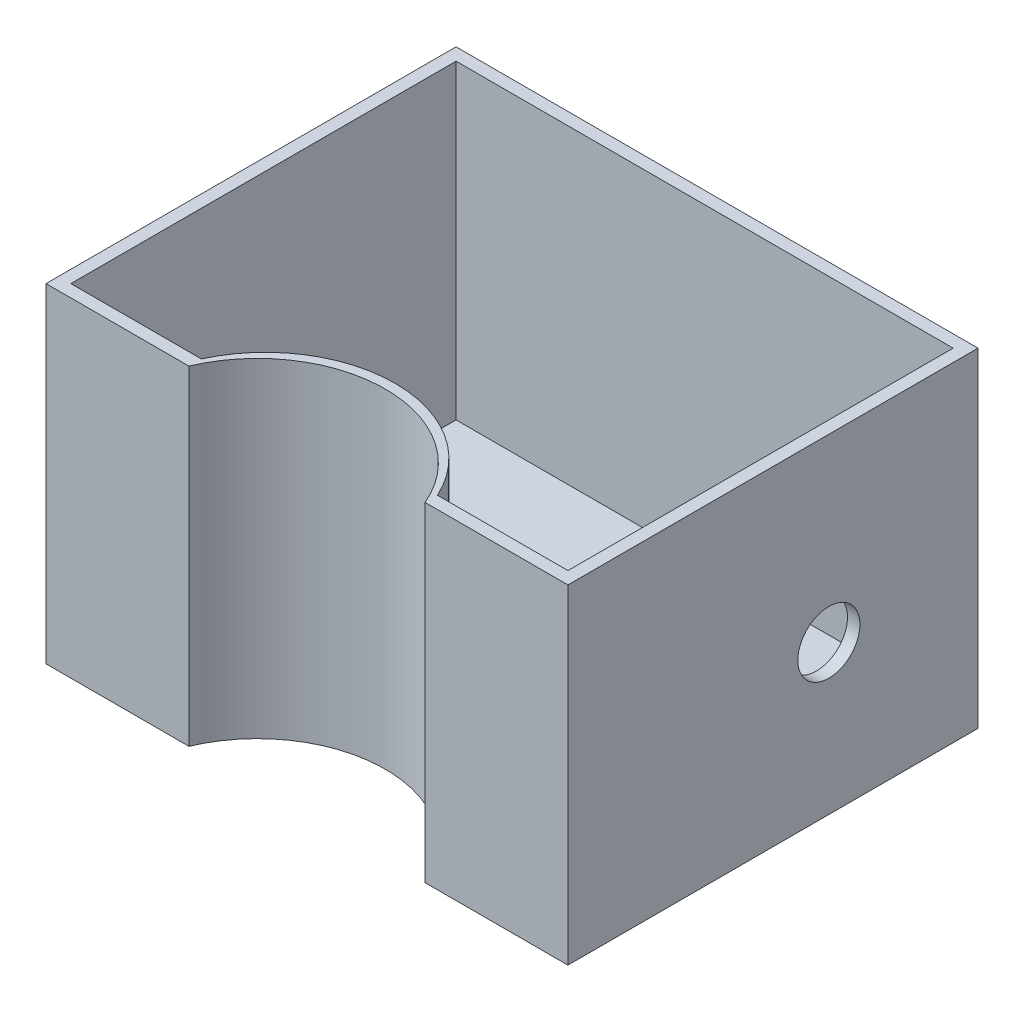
ISO-10303-21;
HEADER;
FILE_DESCRIPTION(('STEP AP214'),'2;1');
FILE_NAME('part.step','',(''),(''),'','','');
FILE_SCHEMA(('AUTOMOTIVE_DESIGN { 1 0 10303 214 1 1 1 1 }'));
ENDSEC;
DATA;
#1=APPLICATION_CONTEXT('core data for automotive mechanical design processes');
#2=APPLICATION_PROTOCOL_DEFINITION('international standard','automotive_design',2000,#1);
#3=PRODUCT_CONTEXT('',#1,'mechanical');
#4=PRODUCT('Part','Part','',(#3));
#5=PRODUCT_RELATED_PRODUCT_CATEGORY('part','',(#4));
#6=PRODUCT_DEFINITION_FORMATION('','',#4);
#7=PRODUCT_DEFINITION_CONTEXT('part definition',#1,'design');
#8=PRODUCT_DEFINITION('design','',#6,#7);
#9=PRODUCT_DEFINITION_SHAPE('','',#8);
#10=(LENGTH_UNIT() NAMED_UNIT(*) SI_UNIT(.MILLI.,.METRE.));
#11=(NAMED_UNIT(*) PLANE_ANGLE_UNIT() SI_UNIT($,.RADIAN.));
#12=(NAMED_UNIT(*) SI_UNIT($,.STERADIAN.) SOLID_ANGLE_UNIT());
#13=UNCERTAINTY_MEASURE_WITH_UNIT(LENGTH_MEASURE(1.E-05),#10,'distance_accuracy_value','');
#14=(GEOMETRIC_REPRESENTATION_CONTEXT(3) GLOBAL_UNCERTAINTY_ASSIGNED_CONTEXT((#13)) GLOBAL_UNIT_ASSIGNED_CONTEXT((#10,
#11,#12)) REPRESENTATION_CONTEXT('',''));
#15=CARTESIAN_POINT('',(0.,0.,0.));
#16=DIRECTION('',(0.,0.,1.));
#17=DIRECTION('',(1.,0.,0.));
#18=AXIS2_PLACEMENT_3D('',#15,#16,#17);
#19=CARTESIAN_POINT('',(40.,50.,10.));
#20=DIRECTION('',(0.,-1.,0.));
#21=DIRECTION('',(0.,0.,-1.));
#22=AXIS2_PLACEMENT_3D('',#19,#20,#21);
#23=PLANE('',#22);
#24=DIRECTION('',(1.,0.,0.));
#25=VECTOR('',#24,1.);
#26=CARTESIAN_POINT('',(-1.99999999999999,50.,2.00000000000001));
#27=LINE('',#26,#25);
#28=CARTESIAN_POINT('',(-1.99999999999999,50.,2.00000000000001));
#29=VERTEX_POINT('',#28);
#30=CARTESIAN_POINT('',(21.,50.,2.00000000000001));
#31=VERTEX_POINT('',#30);
#32=EDGE_CURVE('E144',#29,#31,#27,.T.);
#33=ORIENTED_EDGE('',*,*,#32,.T.);
#34=CARTESIAN_POINT('',(40.,50.,10.));
#35=DIRECTION('',(0.,-1.,0.));
#36=DIRECTION('',(0.,0.,-1.));
#37=AXIS2_PLACEMENT_3D('',#34,#35,#36);
#38=CIRCLE('',#37,20.6155281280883);
#39=CARTESIAN_POINT('',(59.,50.,1.99999999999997));
#40=VERTEX_POINT('',#39);
#41=EDGE_CURVE('E185',#31,#40,#38,.T.);
#42=ORIENTED_EDGE('',*,*,#41,.T.);
#43=DIRECTION('',(-1.,0.,0.));
#44=VECTOR('',#43,1.);
#45=CARTESIAN_POINT('',(82.,50.,1.99999999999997));
#46=LINE('',#45,#44);
#47=CARTESIAN_POINT('',(82.,50.,1.99999999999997));
#48=VERTEX_POINT('',#47);
#49=EDGE_CURVE('E188',#48,#40,#46,.T.);
#50=ORIENTED_EDGE('',*,*,#49,.F.);
#51=DIRECTION('',(0.,0.,1.));
#52=VECTOR('',#51,1.);
#53=CARTESIAN_POINT('',(82.,50.,-64.));
#54=LINE('',#53,#52);
#55=CARTESIAN_POINT('',(82.,50.,-64.));
#56=VERTEX_POINT('',#55);
#57=EDGE_CURVE('E191',#56,#48,#54,.T.);
#58=ORIENTED_EDGE('',*,*,#57,.F.);
#59=DIRECTION('',(1.,0.,0.));
#60=VECTOR('',#59,1.);
#61=CARTESIAN_POINT('',(-1.99999999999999,50.,-64.));
#62=LINE('',#61,#60);
#63=CARTESIAN_POINT('',(-1.99999999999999,50.,-64.));
#64=VERTEX_POINT('',#63);
#65=EDGE_CURVE('E194',#64,#56,#62,.T.);
#66=ORIENTED_EDGE('',*,*,#65,.F.);
#67=DIRECTION('',(0.,0.,-1.));
#68=VECTOR('',#67,1.);
#69=CARTESIAN_POINT('',(-1.99999999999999,50.,2.00000000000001));
#70=LINE('',#69,#68);
#71=EDGE_CURVE('E197',#29,#64,#70,.T.);
#72=ORIENTED_EDGE('',*,*,#71,.F.);
#73=EDGE_LOOP('',(#33,#42,#50,#58,#66,#72));
#74=FACE_BOUND('',#73,.T.);
#75=DIRECTION('',(1.,0.,0.));
#76=VECTOR('',#75,1.);
#77=CARTESIAN_POINT('',(0.,50.,0.));
#78=LINE('',#77,#76);
#79=CARTESIAN_POINT('',(0.,50.,0.));
#80=VERTEX_POINT('',#79);
#81=CARTESIAN_POINT('',(20.9999999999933,50.,0.));
#82=VERTEX_POINT('',#81);
#83=EDGE_CURVE('E125',#80,#82,#78,.T.);
#84=ORIENTED_EDGE('',*,*,#83,.F.);
#85=DIRECTION('',(0.,0.,-1.));
#86=VECTOR('',#85,1.);
#87=CARTESIAN_POINT('',(0.,50.,0.));
#88=LINE('',#87,#86);
#89=CARTESIAN_POINT('',(0.,50.,-62.));
#90=VERTEX_POINT('',#89);
#91=EDGE_CURVE('E158',#80,#90,#88,.T.);
#92=ORIENTED_EDGE('',*,*,#91,.T.);
#93=DIRECTION('',(1.,0.,0.));
#94=VECTOR('',#93,1.);
#95=CARTESIAN_POINT('',(0.,50.,-62.));
#96=LINE('',#95,#94);
#97=CARTESIAN_POINT('',(80.,50.,-62.));
#98=VERTEX_POINT('',#97);
#99=EDGE_CURVE('E52',#90,#98,#96,.T.);
#100=ORIENTED_EDGE('',*,*,#99,.T.);
#101=DIRECTION('',(0.,0.,1.));
#102=VECTOR('',#101,1.);
#103=CARTESIAN_POINT('',(80.,50.,0.));
#104=LINE('',#103,#102);
#105=CARTESIAN_POINT('',(80.,50.,0.));
#106=VERTEX_POINT('',#105);
#107=EDGE_CURVE('E152',#98,#106,#104,.T.);
#108=ORIENTED_EDGE('',*,*,#107,.T.);
#109=DIRECTION('',(-1.,0.,0.));
#110=VECTOR('',#109,1.);
#111=CARTESIAN_POINT('',(0.,50.,0.));
#112=LINE('',#111,#110);
#113=CARTESIAN_POINT('',(59.,50.,0.));
#114=VERTEX_POINT('',#113);
#115=EDGE_CURVE('E150',#106,#114,#112,.T.);
#116=ORIENTED_EDGE('',*,*,#115,.T.);
#117=CARTESIAN_POINT('',(39.9999999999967,50.,8.70689382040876));
#118=DIRECTION('',(0.,1.,0.));
#119=DIRECTION('',(0.,0.,1.));
#120=AXIS2_PLACEMENT_3D('',#117,#118,#119);
#121=CIRCLE('',#120,20.9);
#122=EDGE_CURVE('E136',#82,#114,#121,.F.);
#123=ORIENTED_EDGE('',*,*,#122,.F.);
#124=EDGE_LOOP('',(#84,#92,#100,#108,#116,#123));
#125=FACE_BOUND('',#124,.T.);
#126=ADVANCED_FACE('F35',(#74,#125),#23,.F.);
#127=CARTESIAN_POINT('',(-1.99999999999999,-3.,2.00000000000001));
#128=DIRECTION('',(0.,0.,1.));
#129=DIRECTION('',(1.,0.,0.));
#130=AXIS2_PLACEMENT_3D('',#127,#128,#129);
#131=PLANE('',#130);
#132=DIRECTION('',(0.,1.,0.));
#133=VECTOR('',#132,1.);
#134=CARTESIAN_POINT('',(21.,-3.,2.00000000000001));
#135=LINE('',#134,#133);
#136=CARTESIAN_POINT('',(21.,-3.,2.00000000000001));
#137=VERTEX_POINT('',#136);
#138=EDGE_CURVE('E39',#137,#31,#135,.T.);
#139=ORIENTED_EDGE('',*,*,#138,.T.);
#140=ORIENTED_EDGE('',*,*,#32,.F.);
#141=DIRECTION('',(0.,1.,0.));
#142=VECTOR('',#141,1.);
#143=CARTESIAN_POINT('',(-1.99999999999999,-3.,2.00000000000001));
#144=LINE('',#143,#142);
#145=CARTESIAN_POINT('',(-1.99999999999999,-3.,2.00000000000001));
#146=VERTEX_POINT('',#145);
#147=EDGE_CURVE('E11',#146,#29,#144,.T.);
#148=ORIENTED_EDGE('',*,*,#147,.F.);
#149=DIRECTION('',(1.,0.,0.));
#150=VECTOR('',#149,1.);
#151=CARTESIAN_POINT('',(-1.99999999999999,-3.,2.00000000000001));
#152=LINE('',#151,#150);
#153=EDGE_CURVE('E200',#146,#137,#152,.T.);
#154=ORIENTED_EDGE('',*,*,#153,.T.);
#155=EDGE_LOOP('',(#139,#140,#148,#154));
#156=FACE_BOUND('',#155,.T.);
#157=ADVANCED_FACE('F37',(#156),#131,.T.);
#158=CARTESIAN_POINT('',(-1.99999999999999,-3.,2.00000000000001));
#159=DIRECTION('',(1.,0.,0.));
#160=DIRECTION('',(0.,0.,-1.));
#161=AXIS2_PLACEMENT_3D('',#158,#159,#160);
#162=PLANE('',#161);
#163=ORIENTED_EDGE('',*,*,#147,.T.);
#164=ORIENTED_EDGE('',*,*,#71,.T.);
#165=DIRECTION('',(0.,1.,0.));
#166=VECTOR('',#165,1.);
#167=CARTESIAN_POINT('',(-1.99999999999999,-3.,-64.));
#168=LINE('',#167,#166);
#169=CARTESIAN_POINT('',(-1.99999999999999,-3.,-64.));
#170=VERTEX_POINT('',#169);
#171=EDGE_CURVE('E44',#170,#64,#168,.T.);
#172=ORIENTED_EDGE('',*,*,#171,.F.);
#173=DIRECTION('',(0.,0.,-1.));
#174=VECTOR('',#173,1.);
#175=CARTESIAN_POINT('',(-1.99999999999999,-3.,2.00000000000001));
#176=LINE('',#175,#174);
#177=EDGE_CURVE('E211',#146,#170,#176,.T.);
#178=ORIENTED_EDGE('',*,*,#177,.F.);
#179=EDGE_LOOP('',(#163,#164,#172,#178));
#180=FACE_BOUND('',#179,.T.);
#181=ADVANCED_FACE('F231',(#180),#162,.F.);
#182=CARTESIAN_POINT('',(-1.99999999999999,-3.,-64.));
#183=DIRECTION('',(0.,0.,1.));
#184=DIRECTION('',(1.,0.,0.));
#185=AXIS2_PLACEMENT_3D('',#182,#183,#184);
#186=PLANE('',#185);
#187=ORIENTED_EDGE('',*,*,#171,.T.);
#188=ORIENTED_EDGE('',*,*,#65,.T.);
#189=DIRECTION('',(0.,1.,0.));
#190=VECTOR('',#189,1.);
#191=CARTESIAN_POINT('',(82.,-3.,-64.));
#192=LINE('',#191,#190);
#193=CARTESIAN_POINT('',(82.,-3.,-64.));
#194=VERTEX_POINT('',#193);
#195=EDGE_CURVE('E214',#194,#56,#192,.T.);
#196=ORIENTED_EDGE('',*,*,#195,.F.);
#197=DIRECTION('',(1.,0.,0.));
#198=VECTOR('',#197,1.);
#199=CARTESIAN_POINT('',(-1.99999999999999,-3.,-64.));
#200=LINE('',#199,#198);
#201=EDGE_CURVE('E209',#170,#194,#200,.T.);
#202=ORIENTED_EDGE('',*,*,#201,.F.);
#203=EDGE_LOOP('',(#187,#188,#196,#202));
#204=FACE_BOUND('',#203,.T.);
#205=ADVANCED_FACE('F244',(#204),#186,.F.);
#206=CARTESIAN_POINT('',(82.,-3.,-64.));
#207=DIRECTION('',(-1.,0.,0.));
#208=DIRECTION('',(0.,0.,1.));
#209=AXIS2_PLACEMENT_3D('',#206,#207,#208);
#210=PLANE('',#209);
#211=CARTESIAN_POINT('',(82.,21.,-40.));
#212=DIRECTION('',(1.,0.,0.));
#213=DIRECTION('',(0.,0.,-1.));
#214=AXIS2_PLACEMENT_3D('',#211,#212,#213);
#215=CIRCLE('',#214,5.);
#216=CARTESIAN_POINT('',(82.,21.,-35.));
#217=VERTEX_POINT('',#216);
#218=EDGE_CURVE('E377',#217,#217,#215,.T.);
#219=ORIENTED_EDGE('',*,*,#218,.F.);
#220=EDGE_LOOP('',(#219));
#221=FACE_BOUND('',#220,.T.);
#222=ORIENTED_EDGE('',*,*,#195,.T.);
#223=ORIENTED_EDGE('',*,*,#57,.T.);
#224=DIRECTION('',(0.,1.,0.));
#225=VECTOR('',#224,1.);
#226=CARTESIAN_POINT('',(82.,-3.,1.99999999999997));
#227=LINE('',#226,#225);
#228=CARTESIAN_POINT('',(82.,-3.,1.99999999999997));
#229=VERTEX_POINT('',#228);
#230=EDGE_CURVE('E216',#229,#48,#227,.T.);
#231=ORIENTED_EDGE('',*,*,#230,.F.);
#232=DIRECTION('',(0.,0.,1.));
#233=VECTOR('',#232,1.);
#234=CARTESIAN_POINT('',(82.,-3.,-64.));
#235=LINE('',#234,#233);
#236=EDGE_CURVE('E207',#194,#229,#235,.T.);
#237=ORIENTED_EDGE('',*,*,#236,.F.);
#238=EDGE_LOOP('',(#222,#223,#231,#237));
#239=FACE_BOUND('',#238,.T.);
#240=ADVANCED_FACE('F241',(#221,#239),#210,.F.);
#241=CARTESIAN_POINT('',(82.,-3.,1.99999999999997));
#242=DIRECTION('',(0.,0.,-1.));
#243=DIRECTION('',(-1.,0.,0.));
#244=AXIS2_PLACEMENT_3D('',#241,#242,#243);
#245=PLANE('',#244);
#246=ORIENTED_EDGE('',*,*,#230,.T.);
#247=ORIENTED_EDGE('',*,*,#49,.T.);
#248=DIRECTION('',(0.,1.,0.));
#249=VECTOR('',#248,1.);
#250=CARTESIAN_POINT('',(59.,-3.,1.99999999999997));
#251=LINE('',#250,#249);
#252=CARTESIAN_POINT('',(59.,-3.,1.99999999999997));
#253=VERTEX_POINT('',#252);
#254=EDGE_CURVE('E217',#253,#40,#251,.T.);
#255=ORIENTED_EDGE('',*,*,#254,.F.);
#256=DIRECTION('',(-1.,0.,0.));
#257=VECTOR('',#256,1.);
#258=CARTESIAN_POINT('',(82.,-3.,1.99999999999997));
#259=LINE('',#258,#257);
#260=EDGE_CURVE('E205',#229,#253,#259,.T.);
#261=ORIENTED_EDGE('',*,*,#260,.F.);
#262=EDGE_LOOP('',(#246,#247,#255,#261));
#263=FACE_BOUND('',#262,.T.);
#264=ADVANCED_FACE('F239',(#263),#245,.F.);
#265=CARTESIAN_POINT('',(40.,-3.,10.));
#266=DIRECTION('',(0.,1.,0.));
#267=DIRECTION('',(0.,0.,1.));
#268=AXIS2_PLACEMENT_3D('',#265,#266,#267);
#269=CYLINDRICAL_SURFACE('',#268,20.6155281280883);
#270=ORIENTED_EDGE('',*,*,#254,.T.);
#271=ORIENTED_EDGE('',*,*,#41,.F.);
#272=ORIENTED_EDGE('',*,*,#138,.F.);
#273=CARTESIAN_POINT('',(40.,-3.,10.));
#274=DIRECTION('',(0.,-1.,0.));
#275=DIRECTION('',(0.,0.,-1.));
#276=AXIS2_PLACEMENT_3D('',#273,#274,#275);
#277=CIRCLE('',#276,20.6155281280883);
#278=EDGE_CURVE('E202',#137,#253,#277,.T.);
#279=ORIENTED_EDGE('',*,*,#278,.T.);
#280=EDGE_LOOP('',(#270,#271,#272,#279));
#281=FACE_BOUND('',#280,.T.);
#282=ADVANCED_FACE('F224',(#281),#269,.F.);
#283=CARTESIAN_POINT('',(40.,-3.,10.));
#284=DIRECTION('',(0.,-1.,0.));
#285=DIRECTION('',(0.,0.,-1.));
#286=AXIS2_PLACEMENT_3D('',#283,#284,#285);
#287=PLANE('',#286);
#288=ORIENTED_EDGE('',*,*,#153,.F.);
#289=ORIENTED_EDGE('',*,*,#177,.T.);
#290=ORIENTED_EDGE('',*,*,#201,.T.);
#291=ORIENTED_EDGE('',*,*,#236,.T.);
#292=ORIENTED_EDGE('',*,*,#260,.T.);
#293=ORIENTED_EDGE('',*,*,#278,.F.);
#294=EDGE_LOOP('',(#288,#289,#290,#291,#292,#293));
#295=FACE_BOUND('',#294,.T.);
#296=ADVANCED_FACE('F234',(#295),#287,.T.);
#297=CARTESIAN_POINT('',(0.,50.,0.));
#298=DIRECTION('',(0.,0.,-1.));
#299=DIRECTION('',(-1.,0.,0.));
#300=AXIS2_PLACEMENT_3D('',#297,#298,#299);
#301=PLANE('',#300);
#302=DIRECTION('',(1.,0.,0.));
#303=VECTOR('',#302,1.);
#304=CARTESIAN_POINT('',(0.,0.,0.));
#305=LINE('',#304,#303);
#306=CARTESIAN_POINT('',(0.,0.,0.));
#307=VERTEX_POINT('',#306);
#308=CARTESIAN_POINT('',(20.9999999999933,0.,0.));
#309=VERTEX_POINT('',#308);
#310=EDGE_CURVE('E160',#307,#309,#305,.T.);
#311=ORIENTED_EDGE('',*,*,#310,.F.);
#312=DIRECTION('',(0.,-1.,0.));
#313=VECTOR('',#312,1.);
#314=CARTESIAN_POINT('',(0.,50.,0.));
#315=LINE('',#314,#313);
#316=EDGE_CURVE('E131',#80,#307,#315,.T.);
#317=ORIENTED_EDGE('',*,*,#316,.F.);
#318=ORIENTED_EDGE('',*,*,#83,.T.);
#319=DIRECTION('',(0.,-1.,0.));
#320=VECTOR('',#319,1.);
#321=CARTESIAN_POINT('',(20.9999999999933,50.,0.));
#322=LINE('',#321,#320);
#323=EDGE_CURVE('E129',#82,#309,#322,.T.);
#324=ORIENTED_EDGE('',*,*,#323,.T.);
#325=EDGE_LOOP('',(#311,#317,#318,#324));
#326=FACE_BOUND('',#325,.T.);
#327=ADVANCED_FACE('F128',(#326),#301,.T.);
#328=CARTESIAN_POINT('',(39.9999999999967,50.,8.70689382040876));
#329=DIRECTION('',(0.,-1.,0.));
#330=DIRECTION('',(0.,0.,-1.));
#331=AXIS2_PLACEMENT_3D('',#328,#329,#330);
#332=CYLINDRICAL_SURFACE('',#331,20.9);
#333=CARTESIAN_POINT('',(39.9999999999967,0.,8.70689382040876));
#334=DIRECTION('',(0.,1.,0.));
#335=DIRECTION('',(0.,0.,1.));
#336=AXIS2_PLACEMENT_3D('',#333,#334,#335);
#337=CIRCLE('',#336,20.9);
#338=CARTESIAN_POINT('',(59.,0.,0.));
#339=VERTEX_POINT('',#338);
#340=EDGE_CURVE('E143',#309,#339,#337,.F.);
#341=ORIENTED_EDGE('',*,*,#340,.F.);
#342=ORIENTED_EDGE('',*,*,#323,.F.);
#343=ORIENTED_EDGE('',*,*,#122,.T.);
#344=DIRECTION('',(0.,-1.,0.));
#345=VECTOR('',#344,1.);
#346=CARTESIAN_POINT('',(59.,50.,0.));
#347=LINE('',#346,#345);
#348=EDGE_CURVE('E145',#114,#339,#347,.T.);
#349=ORIENTED_EDGE('',*,*,#348,.T.);
#350=EDGE_LOOP('',(#341,#342,#343,#349));
#351=FACE_BOUND('',#350,.T.);
#352=ADVANCED_FACE('F140',(#351),#332,.T.);
#353=CARTESIAN_POINT('',(0.,50.,0.));
#354=DIRECTION('',(0.,0.,1.));
#355=DIRECTION('',(1.,0.,0.));
#356=AXIS2_PLACEMENT_3D('',#353,#354,#355);
#357=PLANE('',#356);
#358=DIRECTION('',(-1.,0.,0.));
#359=VECTOR('',#358,1.);
#360=CARTESIAN_POINT('',(0.,0.,0.));
#361=LINE('',#360,#359);
#362=CARTESIAN_POINT('',(80.,0.,0.));
#363=VERTEX_POINT('',#362);
#364=EDGE_CURVE('E164',#363,#339,#361,.T.);
#365=ORIENTED_EDGE('',*,*,#364,.T.);
#366=ORIENTED_EDGE('',*,*,#348,.F.);
#367=ORIENTED_EDGE('',*,*,#115,.F.);
#368=DIRECTION('',(0.,-1.,0.));
#369=VECTOR('',#368,1.);
#370=CARTESIAN_POINT('',(80.,50.,0.));
#371=LINE('',#370,#369);
#372=EDGE_CURVE('E180',#106,#363,#371,.T.);
#373=ORIENTED_EDGE('',*,*,#372,.T.);
#374=EDGE_LOOP('',(#365,#366,#367,#373));
#375=FACE_BOUND('',#374,.T.);
#376=ADVANCED_FACE('F295',(#375),#357,.F.);
#377=CARTESIAN_POINT('',(80.,50.,0.));
#378=DIRECTION('',(1.,0.,0.));
#379=DIRECTION('',(0.,0.,-1.));
#380=AXIS2_PLACEMENT_3D('',#377,#378,#379);
#381=PLANE('',#380);
#382=CARTESIAN_POINT('',(80.,21.,-40.));
#383=DIRECTION('',(1.,0.,0.));
#384=DIRECTION('',(0.,0.,-1.));
#385=AXIS2_PLACEMENT_3D('',#382,#383,#384);
#386=CIRCLE('',#385,5.);
#387=CARTESIAN_POINT('',(80.,21.,-35.));
#388=VERTEX_POINT('',#387);
#389=EDGE_CURVE('E162',#388,#388,#386,.F.);
#390=ORIENTED_EDGE('',*,*,#389,.F.);
#391=EDGE_LOOP('',(#390));
#392=FACE_BOUND('',#391,.T.);
#393=DIRECTION('',(0.,0.,1.));
#394=VECTOR('',#393,1.);
#395=CARTESIAN_POINT('',(80.,0.,0.));
#396=LINE('',#395,#394);
#397=CARTESIAN_POINT('',(80.,0.,-62.));
#398=VERTEX_POINT('',#397);
#399=EDGE_CURVE('E167',#398,#363,#396,.T.);
#400=ORIENTED_EDGE('',*,*,#399,.T.);
#401=ORIENTED_EDGE('',*,*,#372,.F.);
#402=ORIENTED_EDGE('',*,*,#107,.F.);
#403=DIRECTION('',(0.,-1.,0.));
#404=VECTOR('',#403,1.);
#405=CARTESIAN_POINT('',(80.,50.,-62.));
#406=LINE('',#405,#404);
#407=EDGE_CURVE('E178',#98,#398,#406,.T.);
#408=ORIENTED_EDGE('',*,*,#407,.T.);
#409=EDGE_LOOP('',(#400,#401,#402,#408));
#410=FACE_BOUND('',#409,.T.);
#411=ADVANCED_FACE('F289',(#392,#410),#381,.F.);
#412=CARTESIAN_POINT('',(0.,50.,-62.));
#413=DIRECTION('',(0.,0.,-1.));
#414=DIRECTION('',(-1.,0.,0.));
#415=AXIS2_PLACEMENT_3D('',#412,#413,#414);
#416=PLANE('',#415);
#417=DIRECTION('',(1.,0.,0.));
#418=VECTOR('',#417,1.);
#419=CARTESIAN_POINT('',(0.,0.,-62.));
#420=LINE('',#419,#418);
#421=CARTESIAN_POINT('',(0.,0.,-62.));
#422=VERTEX_POINT('',#421);
#423=EDGE_CURVE('E170',#422,#398,#420,.T.);
#424=ORIENTED_EDGE('',*,*,#423,.T.);
#425=ORIENTED_EDGE('',*,*,#407,.F.);
#426=ORIENTED_EDGE('',*,*,#99,.F.);
#427=DIRECTION('',(0.,-1.,0.));
#428=VECTOR('',#427,1.);
#429=CARTESIAN_POINT('',(0.,50.,-62.));
#430=LINE('',#429,#428);
#431=EDGE_CURVE('E176',#90,#422,#430,.T.);
#432=ORIENTED_EDGE('',*,*,#431,.T.);
#433=EDGE_LOOP('',(#424,#425,#426,#432));
#434=FACE_BOUND('',#433,.T.);
#435=ADVANCED_FACE('F294',(#434),#416,.F.);
#436=CARTESIAN_POINT('',(0.,50.,0.));
#437=DIRECTION('',(-1.,0.,0.));
#438=DIRECTION('',(0.,0.,1.));
#439=AXIS2_PLACEMENT_3D('',#436,#437,#438);
#440=PLANE('',#439);
#441=DIRECTION('',(0.,0.,-1.));
#442=VECTOR('',#441,1.);
#443=CARTESIAN_POINT('',(0.,0.,0.));
#444=LINE('',#443,#442);
#445=EDGE_CURVE('E137',#307,#422,#444,.T.);
#446=ORIENTED_EDGE('',*,*,#445,.T.);
#447=ORIENTED_EDGE('',*,*,#431,.F.);
#448=ORIENTED_EDGE('',*,*,#91,.F.);
#449=ORIENTED_EDGE('',*,*,#316,.T.);
#450=EDGE_LOOP('',(#446,#447,#448,#449));
#451=FACE_BOUND('',#450,.T.);
#452=ADVANCED_FACE('F305',(#451),#440,.F.);
#453=CARTESIAN_POINT('',(0.,0.,0.));
#454=DIRECTION('',(0.,1.,0.));
#455=DIRECTION('',(0.,0.,1.));
#456=AXIS2_PLACEMENT_3D('',#453,#454,#455);
#457=PLANE('',#456);
#458=ORIENTED_EDGE('',*,*,#310,.T.);
#459=ORIENTED_EDGE('',*,*,#340,.T.);
#460=ORIENTED_EDGE('',*,*,#364,.F.);
#461=ORIENTED_EDGE('',*,*,#399,.F.);
#462=ORIENTED_EDGE('',*,*,#423,.F.);
#463=ORIENTED_EDGE('',*,*,#445,.F.);
#464=EDGE_LOOP('',(#458,#459,#460,#461,#462,#463));
#465=FACE_BOUND('',#464,.T.);
#466=ADVANCED_FACE('F284',(#465),#457,.T.);
#467=CARTESIAN_POINT('',(82.,21.,-40.));
#468=DIRECTION('',(-1.,0.,0.));
#469=DIRECTION('',(0.,0.,1.));
#470=AXIS2_PLACEMENT_3D('',#467,#468,#469);
#471=CYLINDRICAL_SURFACE('',#470,5.);
#472=CARTESIAN_POINT('',(82.,21.,-35.));
#473=CARTESIAN_POINT('',(81.9791666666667,21.,-35.));
#474=CARTESIAN_POINT('',(81.9583333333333,21.,-35.));
#475=CARTESIAN_POINT('',(81.9166666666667,21.,-35.));
#476=CARTESIAN_POINT('',(81.8958333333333,21.,-35.));
#477=CARTESIAN_POINT('',(81.8541666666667,21.,-35.));
#478=CARTESIAN_POINT('',(81.8333333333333,21.,-35.));
#479=CARTESIAN_POINT('',(81.7916666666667,21.,-35.));
#480=CARTESIAN_POINT('',(81.7708333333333,21.,-35.));
#481=CARTESIAN_POINT('',(81.7291666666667,21.,-35.));
#482=CARTESIAN_POINT('',(81.7083333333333,21.,-35.));
#483=CARTESIAN_POINT('',(81.6666666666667,21.,-35.));
#484=CARTESIAN_POINT('',(81.6458333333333,21.,-35.));
#485=CARTESIAN_POINT('',(81.6041666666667,21.,-35.));
#486=CARTESIAN_POINT('',(81.5833333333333,21.,-35.));
#487=CARTESIAN_POINT('',(81.5416666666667,21.,-35.));
#488=CARTESIAN_POINT('',(81.5208333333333,21.,-35.));
#489=CARTESIAN_POINT('',(81.4791666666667,21.,-35.));
#490=CARTESIAN_POINT('',(81.4583333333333,21.,-35.));
#491=CARTESIAN_POINT('',(81.4166666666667,21.,-35.));
#492=CARTESIAN_POINT('',(81.3958333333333,21.,-35.));
#493=CARTESIAN_POINT('',(81.3541666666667,21.,-35.));
#494=CARTESIAN_POINT('',(81.3333333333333,21.,-35.));
#495=CARTESIAN_POINT('',(81.2916666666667,21.,-35.));
#496=CARTESIAN_POINT('',(81.2708333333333,21.,-35.));
#497=CARTESIAN_POINT('',(81.2291666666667,21.,-35.));
#498=CARTESIAN_POINT('',(81.2083333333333,21.,-35.));
#499=CARTESIAN_POINT('',(81.1666666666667,21.,-35.));
#500=CARTESIAN_POINT('',(81.1458333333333,21.,-35.));
#501=CARTESIAN_POINT('',(81.1041666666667,21.,-35.));
#502=CARTESIAN_POINT('',(81.0833333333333,21.,-35.));
#503=CARTESIAN_POINT('',(81.0416666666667,21.,-35.));
#504=CARTESIAN_POINT('',(81.0208333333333,21.,-35.));
#505=CARTESIAN_POINT('',(80.9791666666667,21.,-35.));
#506=CARTESIAN_POINT('',(80.9583333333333,21.,-35.));
#507=CARTESIAN_POINT('',(80.9166666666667,21.,-35.));
#508=CARTESIAN_POINT('',(80.8958333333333,21.,-35.));
#509=CARTESIAN_POINT('',(80.8541666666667,21.,-35.));
#510=CARTESIAN_POINT('',(80.8333333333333,21.,-35.));
#511=CARTESIAN_POINT('',(80.7916666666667,21.,-35.));
#512=CARTESIAN_POINT('',(80.7708333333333,21.,-35.));
#513=CARTESIAN_POINT('',(80.7291666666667,21.,-35.));
#514=CARTESIAN_POINT('',(80.7083333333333,21.,-35.));
#515=CARTESIAN_POINT('',(80.6666666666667,21.,-35.));
#516=CARTESIAN_POINT('',(80.6458333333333,21.,-35.));
#517=CARTESIAN_POINT('',(80.6041666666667,21.,-35.));
#518=CARTESIAN_POINT('',(80.5833333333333,21.,-35.));
#519=CARTESIAN_POINT('',(80.5416666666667,21.,-35.));
#520=CARTESIAN_POINT('',(80.5208333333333,21.,-35.));
#521=CARTESIAN_POINT('',(80.4791666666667,21.,-35.));
#522=CARTESIAN_POINT('',(80.4583333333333,21.,-35.));
#523=CARTESIAN_POINT('',(80.4166666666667,21.,-35.));
#524=CARTESIAN_POINT('',(80.3958333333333,21.,-35.));
#525=CARTESIAN_POINT('',(80.3541666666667,21.,-35.));
#526=CARTESIAN_POINT('',(80.3333333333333,21.,-35.));
#527=CARTESIAN_POINT('',(80.2916666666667,21.,-35.));
#528=CARTESIAN_POINT('',(80.2708333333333,21.,-35.));
#529=CARTESIAN_POINT('',(80.2291666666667,21.,-35.));
#530=CARTESIAN_POINT('',(80.2083333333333,21.,-35.));
#531=CARTESIAN_POINT('',(80.1666666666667,21.,-35.));
#532=CARTESIAN_POINT('',(80.1458333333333,21.,-35.));
#533=CARTESIAN_POINT('',(80.1041666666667,21.,-35.));
#534=CARTESIAN_POINT('',(80.0833333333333,21.,-35.));
#535=CARTESIAN_POINT('',(80.0416666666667,21.,-35.));
#536=CARTESIAN_POINT('',(80.0208333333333,21.,-35.));
#537=CARTESIAN_POINT('',(80.,21.,-35.));
#538=B_SPLINE_CURVE_WITH_KNOTS('',3,(#472,#473,#474,#475,#476,#477,#478,#479,#480,#481,#482,
#483,#484,#485,#486,#487,#488,#489,#490,#491,#492,#493,#494,#495,#496,#497,#498,#499,#500,#501,
#502,#503,#504,#505,#506,#507,#508,#509,#510,#511,#512,#513,#514,#515,#516,#517,#518,#519,#520,
#521,#522,#523,#524,#525,#526,#527,#528,#529,#530,#531,#532,#533,#534,#535,#536,#537),
.UNSPECIFIED.,.F.,.F.,(4,2,2,2,2,2,2,2,2,2,2,2,2,2,2,2,2,2,2,2,2,2,2,2,2,2,2,2,2,2,2,2,4),(0.,
0.0624999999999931,0.125,0.187499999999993,0.25,0.312499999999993,0.375,0.437499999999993,0.5,
0.562499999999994,0.625000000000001,0.687499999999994,0.750000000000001,0.812499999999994,
0.875000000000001,0.937499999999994,1.,1.06249999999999,1.125,1.18749999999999,1.25,
1.31249999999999,1.375,1.43749999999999,1.5,1.56249999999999,1.625,1.68749999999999,1.75,
1.81249999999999,1.875,1.93749999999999,2.),.UNSPECIFIED.);
#539=EDGE_CURVE('BSEAM315',#217,#388,#538,.T.);
#540=ORIENTED_EDGE('',*,*,#218,.T.);
#541=ORIENTED_EDGE('',*,*,#389,.T.);
#542=ORIENTED_EDGE('',*,*,#539,.T.);
#543=ORIENTED_EDGE('',*,*,#539,.F.);
#544=EDGE_LOOP('',(#540,#542,#541,#543));
#545=FACE_BOUND('',#544,.T.);
#546=ADVANCED_FACE('F315',(#545),#471,.F.);
#547=CLOSED_SHELL('',(#126,#157,#181,#205,#240,#264,#282,#296,#327,#352,#376,#411,#435,#452,
#466,#546));
#548=MANIFOLD_SOLID_BREP('B2',#547);
#549=ADVANCED_BREP_SHAPE_REPRESENTATION('',(#18,#548),#14);
#550=SHAPE_DEFINITION_REPRESENTATION(#9,#549);
ENDSEC;
END-ISO-10303-21;
